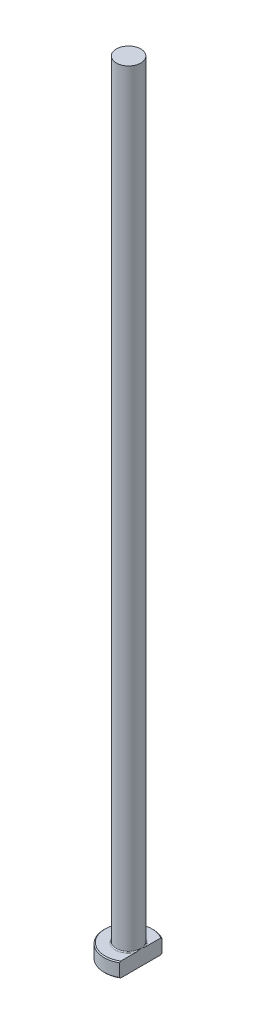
ISO-10303-21;
HEADER;
FILE_DESCRIPTION(('STEP AP214'),'2;1');
FILE_NAME('part.step','',(''),(''),'','','');
FILE_SCHEMA(('AUTOMOTIVE_DESIGN { 1 0 10303 214 1 1 1 1 }'));
ENDSEC;
DATA;
#1=APPLICATION_CONTEXT('core data for automotive mechanical design processes');
#2=APPLICATION_PROTOCOL_DEFINITION('international standard','automotive_design',2000,#1);
#3=PRODUCT_CONTEXT('',#1,'mechanical');
#4=PRODUCT('Part','Part','',(#3));
#5=PRODUCT_RELATED_PRODUCT_CATEGORY('part','',(#4));
#6=PRODUCT_DEFINITION_FORMATION('','',#4);
#7=PRODUCT_DEFINITION_CONTEXT('part definition',#1,'design');
#8=PRODUCT_DEFINITION('design','',#6,#7);
#9=PRODUCT_DEFINITION_SHAPE('','',#8);
#10=(LENGTH_UNIT() NAMED_UNIT(*) SI_UNIT(.MILLI.,.METRE.));
#11=(NAMED_UNIT(*) PLANE_ANGLE_UNIT() SI_UNIT($,.RADIAN.));
#12=(NAMED_UNIT(*) SI_UNIT($,.STERADIAN.) SOLID_ANGLE_UNIT());
#13=UNCERTAINTY_MEASURE_WITH_UNIT(LENGTH_MEASURE(1.E-05),#10,'distance_accuracy_value','');
#14=(GEOMETRIC_REPRESENTATION_CONTEXT(3) GLOBAL_UNCERTAINTY_ASSIGNED_CONTEXT((#13)) GLOBAL_UNIT_ASSIGNED_CONTEXT((#10,
#11,#12)) REPRESENTATION_CONTEXT('',''));
#15=CARTESIAN_POINT('',(0.,0.,0.));
#16=DIRECTION('',(0.,0.,1.));
#17=DIRECTION('',(1.,0.,0.));
#18=AXIS2_PLACEMENT_3D('',#15,#16,#17);
#19=CARTESIAN_POINT('',(0.,0.,0.));
#20=DIRECTION('',(0.,-1.,0.));
#21=DIRECTION('',(0.,0.,-1.));
#22=AXIS2_PLACEMENT_3D('',#19,#20,#21);
#23=PLANE('',#22);
#24=CARTESIAN_POINT('',(0.,0.,0.));
#25=DIRECTION('',(0.,-1.,0.));
#26=DIRECTION('',(0.,0.,-1.));
#27=AXIS2_PLACEMENT_3D('',#24,#25,#26);
#28=CIRCLE('',#27,4.79999999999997);
#29=CARTESIAN_POINT('',(2.49999999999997,0.,4.09756024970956));
#30=VERTEX_POINT('',#29);
#31=CARTESIAN_POINT('',(2.49999999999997,0.,-4.09756024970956));
#32=VERTEX_POINT('',#31);
#33=EDGE_CURVE('E98',#30,#32,#28,.T.);
#34=ORIENTED_EDGE('',*,*,#33,.T.);
#35=DIRECTION('',(0.,0.,1.));
#36=VECTOR('',#35,1.);
#37=CARTESIAN_POINT('',(2.49999999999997,0.,-4.33012701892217));
#38=LINE('',#37,#36);
#39=EDGE_CURVE('E83',#32,#30,#38,.T.);
#40=ORIENTED_EDGE('',*,*,#39,.T.);
#41=EDGE_LOOP('',(#34,#40));
#42=FACE_BOUND('',#41,.T.);
#43=ADVANCED_FACE('F32',(#42),#23,.T.);
#44=CARTESIAN_POINT('',(0.,259.958771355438,0.));
#45=DIRECTION('',(0.,1.,0.));
#46=DIRECTION('',(0.,0.,1.));
#47=AXIS2_PLACEMENT_3D('',#44,#45,#46);
#48=CYLINDRICAL_SURFACE('',#47,4.99999999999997);
#49=CARTESIAN_POINT('',(0.,2.80000000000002,0.));
#50=DIRECTION('',(0.,1.,0.));
#51=DIRECTION('',(0.,0.,1.));
#52=AXIS2_PLACEMENT_3D('',#49,#50,#51);
#53=CIRCLE('',#52,4.99999999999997);
#54=CARTESIAN_POINT('',(2.49999999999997,2.80000000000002,4.33012701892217));
#55=VERTEX_POINT('',#54);
#56=CARTESIAN_POINT('',(2.49999999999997,2.80000000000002,-4.33012701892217));
#57=VERTEX_POINT('',#56);
#58=EDGE_CURVE('E104',#55,#57,#53,.F.);
#59=ORIENTED_EDGE('',*,*,#58,.T.);
#60=DIRECTION('',(0.,-1.,0.));
#61=VECTOR('',#60,1.);
#62=CARTESIAN_POINT('',(2.49999999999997,160.,-4.33012701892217));
#63=LINE('',#62,#61);
#64=CARTESIAN_POINT('',(2.49999999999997,0.199999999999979,-4.33012701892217));
#65=VERTEX_POINT('',#64);
#66=EDGE_CURVE('E183',#57,#65,#63,.T.);
#67=ORIENTED_EDGE('',*,*,#66,.T.);
#68=CARTESIAN_POINT('',(0.,0.199999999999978,0.));
#69=DIRECTION('',(0.,-1.,0.));
#70=DIRECTION('',(0.,0.,-1.));
#71=AXIS2_PLACEMENT_3D('',#68,#69,#70);
#72=CIRCLE('',#71,4.99999999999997);
#73=CARTESIAN_POINT('',(2.49999999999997,0.199999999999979,4.33012701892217));
#74=VERTEX_POINT('',#73);
#75=EDGE_CURVE('E100',#65,#74,#72,.F.);
#76=ORIENTED_EDGE('',*,*,#75,.T.);
#77=DIRECTION('',(0.,-1.,0.));
#78=VECTOR('',#77,1.);
#79=CARTESIAN_POINT('',(2.49999999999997,160.,4.33012701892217));
#80=LINE('',#79,#78);
#81=EDGE_CURVE('E93',#55,#74,#80,.T.);
#82=ORIENTED_EDGE('',*,*,#81,.F.);
#83=EDGE_LOOP('',(#59,#67,#76,#82));
#84=FACE_BOUND('',#83,.T.);
#85=ADVANCED_FACE('F158',(#84),#48,.T.);
#86=CARTESIAN_POINT('',(-4.99999999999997,3.,0.));
#87=DIRECTION('',(0.,1.,0.));
#88=DIRECTION('',(0.,0.,1.));
#89=AXIS2_PLACEMENT_3D('',#86,#87,#88);
#90=PLANE('',#89);
#91=CARTESIAN_POINT('',(0.,3.,0.));
#92=DIRECTION('',(0.,1.,0.));
#93=DIRECTION('',(0.,0.,1.));
#94=AXIS2_PLACEMENT_3D('',#91,#92,#93);
#95=CIRCLE('',#94,4.80000000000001);
#96=CARTESIAN_POINT('',(2.49999999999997,3.,-4.09756024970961));
#97=VERTEX_POINT('',#96);
#98=CARTESIAN_POINT('',(2.49999999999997,3.,4.09756024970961));
#99=VERTEX_POINT('',#98);
#100=EDGE_CURVE('E178',#97,#99,#95,.T.);
#101=ORIENTED_EDGE('',*,*,#100,.T.);
#102=DIRECTION('',(0.,0.,-1.));
#103=VECTOR('',#102,1.);
#104=CARTESIAN_POINT('',(2.49999999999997,3.,0.));
#105=LINE('',#104,#103);
#106=CARTESIAN_POINT('',(2.49999999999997,2.99999999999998,1.01980390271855));
#107=VERTEX_POINT('',#106);
#108=EDGE_CURVE('E57',#99,#107,#105,.T.);
#109=ORIENTED_EDGE('',*,*,#108,.T.);
#110=CARTESIAN_POINT('',(0.,3.,0.));
#111=DIRECTION('',(0.,1.,0.));
#112=DIRECTION('',(0.,0.,1.));
#113=AXIS2_PLACEMENT_3D('',#110,#111,#112);
#114=CIRCLE('',#113,2.69999999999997);
#115=CARTESIAN_POINT('',(2.49999999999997,2.99999999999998,-1.01980390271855));
#116=VERTEX_POINT('',#115);
#117=EDGE_CURVE('E107',#107,#116,#114,.F.);
#118=ORIENTED_EDGE('',*,*,#117,.T.);
#119=EDGE_CURVE('E136',#116,#97,#105,.T.);
#120=ORIENTED_EDGE('',*,*,#119,.T.);
#121=EDGE_LOOP('',(#101,#109,#118,#120));
#122=FACE_BOUND('',#121,.T.);
#123=ADVANCED_FACE('F147',(#122),#90,.T.);
#124=CARTESIAN_POINT('',(0.,3.,0.));
#125=DIRECTION('',(0.,-1.,0.));
#126=DIRECTION('',(0.,0.,-1.));
#127=AXIS2_PLACEMENT_3D('',#124,#125,#126);
#128=CONICAL_SURFACE('',#127,4.80000000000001,0.785398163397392);
#129=ORIENTED_EDGE('',*,*,#58,.F.);
#130=CARTESIAN_POINT('',(2.49999999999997,-2.05039133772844,9.52786489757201));
#131=CARTESIAN_POINT('',(2.49999999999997,-1.84160367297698,9.31199733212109));
#132=CARTESIAN_POINT('',(2.49999999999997,-1.6330400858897,9.09591231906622));
#133=CARTESIAN_POINT('',(2.49999999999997,-1.21649358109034,8.66317810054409));
#134=CARTESIAN_POINT('',(2.49999999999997,-1.00851067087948,8.44652888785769));
#135=CARTESIAN_POINT('',(2.49999999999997,-0.593157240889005,8.01243155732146));
#136=CARTESIAN_POINT('',(2.49999999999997,-0.385787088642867,7.7949830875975));
#137=CARTESIAN_POINT('',(2.49999999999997,0.0280365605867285,7.35921771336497));
#138=CARTESIAN_POINT('',(2.49999999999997,0.23449006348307,7.14090081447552));
#139=CARTESIAN_POINT('',(2.49999999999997,0.642130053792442,6.70748960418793));
#140=CARTESIAN_POINT('',(2.49999999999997,0.843339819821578,6.49241720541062));
#141=CARTESIAN_POINT('',(2.49999999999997,1.24425381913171,6.06087422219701));
#142=CARTESIAN_POINT('',(2.49999999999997,1.44395806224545,5.84440364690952));
#143=CARTESIAN_POINT('',(2.49999999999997,1.84127751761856,5.4096366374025));
#144=CARTESIAN_POINT('',(2.49999999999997,2.03889317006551,5.19134060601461));
#145=CARTESIAN_POINT('',(2.49999999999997,2.43125043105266,4.75218509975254));
#146=CARTESIAN_POINT('',(2.49999999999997,2.62599215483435,4.53132572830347));
#147=CARTESIAN_POINT('',(2.49999999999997,2.93693788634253,4.17181619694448));
#148=CARTESIAN_POINT('',(2.49999999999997,3.054464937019,4.03431188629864));
#149=CARTESIAN_POINT('',(2.49999999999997,3.28742704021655,3.7575148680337));
#150=CARTESIAN_POINT('',(2.49999999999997,3.40286188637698,3.61822198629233));
#151=CARTESIAN_POINT('',(2.49999999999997,3.63213234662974,3.33586492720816));
#152=CARTESIAN_POINT('',(2.49999999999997,3.745938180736,3.19277645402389));
#153=CARTESIAN_POINT('',(2.49999999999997,3.96956266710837,2.90356071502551));
#154=CARTESIAN_POINT('',(2.49999999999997,4.07938227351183,2.75743418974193));
#155=CARTESIAN_POINT('',(2.49999999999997,4.29502410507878,2.45881038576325));
#156=CARTESIAN_POINT('',(2.49999999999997,4.40076032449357,2.30625006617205));
#157=CARTESIAN_POINT('',(2.49999999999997,4.55286945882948,2.07299325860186));
#158=CARTESIAN_POINT('',(2.49999999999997,4.6025261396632,1.99444197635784));
#159=CARTESIAN_POINT('',(2.49999999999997,4.6990816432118,1.83566827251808));
#160=CARTESIAN_POINT('',(2.49999999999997,4.7459807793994,1.75544604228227));
#161=CARTESIAN_POINT('',(2.49999999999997,4.83578466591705,1.59405362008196));
#162=CARTESIAN_POINT('',(2.49999999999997,4.87873126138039,1.51290702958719));
#163=CARTESIAN_POINT('',(2.49999999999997,4.96038600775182,1.34852090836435));
#164=CARTESIAN_POINT('',(2.49999999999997,4.99909338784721,1.26528100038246));
#165=CARTESIAN_POINT('',(2.49999999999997,5.10703093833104,1.01251774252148));
#166=CARTESIAN_POINT('',(2.49999999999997,5.16843307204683,0.839342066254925));
#167=CARTESIAN_POINT('',(2.49999999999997,5.23490554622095,0.579703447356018));
#168=CARTESIAN_POINT('',(2.49999999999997,5.25253806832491,0.496421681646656));
#169=CARTESIAN_POINT('',(2.49999999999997,5.27986337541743,0.328535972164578));
#170=CARTESIAN_POINT('',(2.49999999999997,5.28955686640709,0.24393214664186));
#171=CARTESIAN_POINT('',(2.49999999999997,5.30031768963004,0.0744340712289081));
#172=CARTESIAN_POINT('',(2.49999999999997,5.30141176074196,-0.0104584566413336));
#173=CARTESIAN_POINT('',(2.49999999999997,5.2949653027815,-0.179916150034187));
#174=CARTESIAN_POINT('',(2.49999999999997,5.28742406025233,-0.26448128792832));
#175=CARTESIAN_POINT('',(2.49999999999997,5.26433424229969,-0.43175473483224));
#176=CARTESIAN_POINT('',(2.49999999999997,5.24885436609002,-0.514472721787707));
#177=CARTESIAN_POINT('',(2.49999999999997,5.21085318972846,-0.678257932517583));
#178=CARTESIAN_POINT('',(2.49999999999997,5.18833104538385,-0.759324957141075));
#179=CARTESIAN_POINT('',(2.49999999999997,5.13718929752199,-0.920001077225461));
#180=CARTESIAN_POINT('',(2.49999999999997,5.10853534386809,-0.999599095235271));
#181=CARTESIAN_POINT('',(2.49999999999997,5.04628092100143,-1.1567927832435));
#182=CARTESIAN_POINT('',(2.49999999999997,5.0126814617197,-1.23438885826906));
#183=CARTESIAN_POINT('',(2.49999999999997,4.90558195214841,-1.46503672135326));
#184=CARTESIAN_POINT('',(2.49999999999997,4.82601567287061,-1.61526350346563));
#185=CARTESIAN_POINT('',(2.49999999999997,4.6563523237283,-1.90970759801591));
#186=CARTESIAN_POINT('',(2.49999999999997,4.56624199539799,-2.05391702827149));
#187=CARTESIAN_POINT('',(2.49999999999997,4.3786220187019,-2.33821627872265));
#188=CARTESIAN_POINT('',(2.49999999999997,4.28108460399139,-2.4782876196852));
#189=CARTESIAN_POINT('',(2.49999999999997,4.08116271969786,-2.75478641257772));
#190=CARTESIAN_POINT('',(2.49999999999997,3.97878070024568,-2.8912156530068));
#191=CARTESIAN_POINT('',(2.49999999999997,3.7691391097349,-3.16313520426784));
#192=CARTESIAN_POINT('',(2.49999999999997,3.66183307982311,-3.29858952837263));
#193=CARTESIAN_POINT('',(2.49999999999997,3.44456217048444,-3.56736427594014));
#194=CARTESIAN_POINT('',(2.49999999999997,3.33459700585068,-3.70068446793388));
#195=CARTESIAN_POINT('',(2.49999999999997,3.11293465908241,-3.96532340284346));
#196=CARTESIAN_POINT('',(2.49999999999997,3.00124232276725,-4.09664621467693));
#197=CARTESIAN_POINT('',(2.49999999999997,2.77631276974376,-4.35796341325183));
#198=CARTESIAN_POINT('',(2.49999999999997,2.66307552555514,-4.48795777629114));
#199=CARTESIAN_POINT('',(2.49999999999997,2.36028773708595,-4.83228553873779));
#200=CARTESIAN_POINT('',(2.49999999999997,2.16967435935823,-5.04568363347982));
#201=CARTESIAN_POINT('',(2.49999999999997,1.78611780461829,-5.4703791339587));
#202=CARTESIAN_POINT('',(2.49999999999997,1.59317456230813,-5.68167648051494));
#203=CARTESIAN_POINT('',(2.49999999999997,1.20540648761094,-6.10290357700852));
#204=CARTESIAN_POINT('',(2.49999999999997,1.01058005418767,-6.3128318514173));
#205=CARTESIAN_POINT('',(2.49999999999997,0.619649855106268,-6.73149551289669));
#206=CARTESIAN_POINT('',(2.49999999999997,0.423546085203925,-6.94023089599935));
#207=CARTESIAN_POINT('',(2.49999999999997,0.038443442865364,-7.34820392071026));
#208=CARTESIAN_POINT('',(2.49999999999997,-0.150515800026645,-7.54747899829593));
#209=CARTESIAN_POINT('',(2.49999999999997,-0.529153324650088,-7.94534601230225));
#210=CARTESIAN_POINT('',(2.49999999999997,-0.718831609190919,-8.14393794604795));
#211=CARTESIAN_POINT('',(2.49999999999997,-1.09855461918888,-8.54034636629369));
#212=CARTESIAN_POINT('',(2.49999999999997,-1.28859869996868,-8.7381634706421));
#213=CARTESIAN_POINT('',(2.49999999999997,-1.66916268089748,-9.13333639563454));
#214=CARTESIAN_POINT('',(2.49999999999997,-1.85968257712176,-9.33069222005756));
#215=CARTESIAN_POINT('',(2.49999999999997,-2.05039133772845,-9.52786489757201));
#216=B_SPLINE_CURVE_WITH_KNOTS('',3,(#130,#131,#132,#133,#134,#135,#136,#137,#138,#139,#140,
#141,#142,#143,#144,#145,#146,#147,#148,#149,#150,#151,#152,#153,#154,#155,#156,#157,#158,#159,
#160,#161,#162,#163,#164,#165,#166,#167,#168,#169,#170,#171,#172,#173,#174,#175,#176,#177,#178,
#179,#180,#181,#182,#183,#184,#185,#186,#187,#188,#189,#190,#191,#192,#193,#194,#195,#196,#197,
#198,#199,#200,#201,#202,#203,#204,#205,#206,#207,#208,#209,#210,#211,#212,#213,#214,#215),
.UNSPECIFIED.,.F.,.F.,(4,2,2,2,2,2,2,2,2,2,2,2,2,2,2,2,2,2,2,2,2,2,2,2,2,2,2,2,2,2,2,2,2,2,2,2,
2,2,2,2,2,2,4),(0.,0.900955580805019,1.80192274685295,2.70335062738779,3.60477268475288,
4.48832484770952,5.37187123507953,6.25522753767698,7.13854832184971,7.68119321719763,
8.22389134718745,8.77232299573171,9.32062249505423,9.87724663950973,10.1559936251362,
10.4347088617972,10.7100145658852,10.9853702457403,11.5339745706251,11.7890461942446,
12.0440951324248,12.2983507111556,12.5526272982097,12.8047396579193,13.0568822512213,
13.3104761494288,13.564018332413,14.0732618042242,14.5831526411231,15.0950533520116,
15.6066978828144,16.125075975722,16.6435099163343,17.1606868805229,17.6778730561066,
18.5362451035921,19.3946412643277,20.2538459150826,21.1130534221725,21.9369112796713,
22.7607723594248,23.5837145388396,24.406649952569),.UNSPECIFIED.);
#217=EDGE_CURVE('E135',#55,#99,#216,.T.);
#218=ORIENTED_EDGE('',*,*,#217,.T.);
#219=ORIENTED_EDGE('',*,*,#100,.F.);
#220=EDGE_CURVE('E127',#97,#57,#216,.T.);
#221=ORIENTED_EDGE('',*,*,#220,.T.);
#222=EDGE_LOOP('',(#129,#218,#219,#221));
#223=FACE_BOUND('',#222,.T.);
#224=ADVANCED_FACE('F143',(#223),#128,.T.);
#225=CARTESIAN_POINT('',(0.,0.199999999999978,0.));
#226=DIRECTION('',(0.,1.,0.));
#227=DIRECTION('',(0.,0.,1.));
#228=AXIS2_PLACEMENT_3D('',#225,#226,#227);
#229=CONICAL_SURFACE('',#228,4.99999999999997,0.785398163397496);
#230=ORIENTED_EDGE('',*,*,#75,.F.);
#231=CARTESIAN_POINT('',(2.49999999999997,5.05039133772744,-9.52786489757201));
#232=CARTESIAN_POINT('',(2.49999999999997,4.84160367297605,-9.31199733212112));
#233=CARTESIAN_POINT('',(2.49999999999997,4.63304008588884,-9.09591231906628));
#234=CARTESIAN_POINT('',(2.49999999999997,4.21649358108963,-8.66317810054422));
#235=CARTESIAN_POINT('',(2.49999999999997,4.00851067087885,-8.44652888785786));
#236=CARTESIAN_POINT('',(2.49999999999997,3.59315724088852,-8.01243155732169));
#237=CARTESIAN_POINT('',(2.49999999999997,3.38578708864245,-7.79498308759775));
#238=CARTESIAN_POINT('',(2.49999999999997,2.97196343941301,-7.35921771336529));
#239=CARTESIAN_POINT('',(2.49999999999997,2.76550993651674,-7.14090081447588));
#240=CARTESIAN_POINT('',(2.49999999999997,2.35786994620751,-6.70748960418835));
#241=CARTESIAN_POINT('',(2.49999999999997,2.15666018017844,-6.49241720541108));
#242=CARTESIAN_POINT('',(2.49999999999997,1.75574618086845,-6.06087422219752));
#243=CARTESIAN_POINT('',(2.49999999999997,1.55604193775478,-5.84440364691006));
#244=CARTESIAN_POINT('',(2.49999999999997,1.1587224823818,-5.40963663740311));
#245=CARTESIAN_POINT('',(2.49999999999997,0.961106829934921,-5.19134060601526));
#246=CARTESIAN_POINT('',(2.49999999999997,0.568749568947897,-4.75218509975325));
#247=CARTESIAN_POINT('',(2.49999999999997,0.374007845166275,-4.53132572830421));
#248=CARTESIAN_POINT('',(2.49999999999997,0.0630621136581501,-4.17181619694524));
#249=CARTESIAN_POINT('',(2.49999999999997,-0.0544649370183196,-4.03431188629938));
#250=CARTESIAN_POINT('',(2.49999999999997,-0.287427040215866,-3.75751486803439));
#251=CARTESIAN_POINT('',(2.49999999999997,-0.402861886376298,-3.618221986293));
#252=CARTESIAN_POINT('',(2.49999999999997,-0.632132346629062,-3.33586492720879));
#253=CARTESIAN_POINT('',(2.49999999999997,-0.745938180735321,-3.1927764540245));
#254=CARTESIAN_POINT('',(2.49999999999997,-0.969562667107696,-2.90356071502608));
#255=CARTESIAN_POINT('',(2.49999999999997,-1.07938227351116,-2.75743418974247));
#256=CARTESIAN_POINT('',(2.49999999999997,-1.29502410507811,-2.45881038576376));
#257=CARTESIAN_POINT('',(2.49999999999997,-1.4007603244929,-2.30625006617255));
#258=CARTESIAN_POINT('',(2.49999999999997,-1.55286945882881,-2.07299325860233));
#259=CARTESIAN_POINT('',(2.49999999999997,-1.60252613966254,-1.99444197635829));
#260=CARTESIAN_POINT('',(2.49999999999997,-1.69908164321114,-1.83566827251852));
#261=CARTESIAN_POINT('',(2.49999999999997,-1.74598077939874,-1.75544604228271));
#262=CARTESIAN_POINT('',(2.49999999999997,-1.83578466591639,-1.59405362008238));
#263=CARTESIAN_POINT('',(2.49999999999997,-1.87873126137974,-1.5129070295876));
#264=CARTESIAN_POINT('',(2.49999999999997,-1.96038600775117,-1.34852090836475));
#265=CARTESIAN_POINT('',(2.49999999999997,-1.99909338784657,-1.26528100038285));
#266=CARTESIAN_POINT('',(2.49999999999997,-2.10703093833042,-1.01251774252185));
#267=CARTESIAN_POINT('',(2.49999999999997,-2.16843307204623,-0.839342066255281));
#268=CARTESIAN_POINT('',(2.49999999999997,-2.23490554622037,-0.579703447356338));
#269=CARTESIAN_POINT('',(2.49999999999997,-2.25253806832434,-0.496421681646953));
#270=CARTESIAN_POINT('',(2.49999999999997,-2.27986337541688,-0.328535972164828));
#271=CARTESIAN_POINT('',(2.49999999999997,-2.28955686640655,-0.243932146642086));
#272=CARTESIAN_POINT('',(2.49999999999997,-2.30031768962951,-0.0744340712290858));
#273=CARTESIAN_POINT('',(2.49999999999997,-2.30141176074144,0.01045845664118));
#274=CARTESIAN_POINT('',(2.49999999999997,-2.29496530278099,0.179916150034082));
#275=CARTESIAN_POINT('',(2.49999999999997,-2.28742406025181,0.26448128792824));
#276=CARTESIAN_POINT('',(2.49999999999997,-2.26433424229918,0.431754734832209));
#277=CARTESIAN_POINT('',(2.49999999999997,-2.24885436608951,0.514472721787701));
#278=CARTESIAN_POINT('',(2.49999999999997,-2.21085318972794,0.678257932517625));
#279=CARTESIAN_POINT('',(2.49999999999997,-2.18833104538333,0.759324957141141));
#280=CARTESIAN_POINT('',(2.49999999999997,-2.13718929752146,0.920001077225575));
#281=CARTESIAN_POINT('',(2.49999999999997,-2.10853534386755,0.999599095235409));
#282=CARTESIAN_POINT('',(2.49999999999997,-2.04628092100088,1.15679278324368));
#283=CARTESIAN_POINT('',(2.49999999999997,-2.01268146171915,1.23438885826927));
#284=CARTESIAN_POINT('',(2.49999999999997,-1.90558195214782,1.46503672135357));
#285=CARTESIAN_POINT('',(2.49999999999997,-1.82601567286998,1.61526350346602));
#286=CARTESIAN_POINT('',(2.49999999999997,-1.6563523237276,1.90970759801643));
#287=CARTESIAN_POINT('',(2.49999999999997,-1.56624199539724,2.05391702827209));
#288=CARTESIAN_POINT('',(2.49999999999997,-1.37862201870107,2.33821627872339));
#289=CARTESIAN_POINT('',(2.49999999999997,-1.28108460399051,2.478287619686));
#290=CARTESIAN_POINT('',(2.49999999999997,-1.08116271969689,2.75478641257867));
#291=CARTESIAN_POINT('',(2.49999999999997,-0.978780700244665,2.89121565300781));
#292=CARTESIAN_POINT('',(2.49999999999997,-0.7691391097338,3.16313520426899));
#293=CARTESIAN_POINT('',(2.49999999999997,-0.66183307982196,3.29858952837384));
#294=CARTESIAN_POINT('',(2.49999999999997,-0.444562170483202,3.56736427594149));
#295=CARTESIAN_POINT('',(2.49999999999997,-0.33459700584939,3.7006844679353));
#296=CARTESIAN_POINT('',(2.49999999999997,-0.112934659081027,3.96532340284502));
#297=CARTESIAN_POINT('',(2.49999999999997,-0.00124232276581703,4.09664621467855));
#298=CARTESIAN_POINT('',(2.49999999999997,0.223687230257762,4.35796341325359));
#299=CARTESIAN_POINT('',(2.49999999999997,0.336924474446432,4.48795777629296));
#300=CARTESIAN_POINT('',(2.49999999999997,0.639712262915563,4.83228553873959));
#301=CARTESIAN_POINT('',(2.49999999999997,0.83032564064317,5.04568363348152));
#302=CARTESIAN_POINT('',(2.49999999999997,1.21388219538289,5.47037913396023));
#303=CARTESIAN_POINT('',(2.49999999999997,1.40682543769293,5.68167648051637));
#304=CARTESIAN_POINT('',(2.49999999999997,1.7945935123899,6.10290357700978));
#305=CARTESIAN_POINT('',(2.49999999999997,1.98941994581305,6.31283185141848));
#306=CARTESIAN_POINT('',(2.49999999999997,2.38035014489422,6.73149551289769));
#307=CARTESIAN_POINT('',(2.49999999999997,2.57645391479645,6.94023089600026));
#308=CARTESIAN_POINT('',(2.49999999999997,2.96155655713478,7.34820392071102));
#309=CARTESIAN_POINT('',(2.49999999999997,3.15051580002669,7.54747899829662));
#310=CARTESIAN_POINT('',(2.49999999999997,3.52915332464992,7.9453460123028));
#311=CARTESIAN_POINT('',(2.49999999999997,3.71883160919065,8.14393794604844));
#312=CARTESIAN_POINT('',(2.49999999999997,4.0985546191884,8.54034636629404));
#313=CARTESIAN_POINT('',(2.49999999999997,4.2885986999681,8.73816347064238));
#314=CARTESIAN_POINT('',(2.49999999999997,4.66916268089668,9.13333639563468));
#315=CARTESIAN_POINT('',(2.49999999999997,4.85968257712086,9.33069222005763));
#316=CARTESIAN_POINT('',(2.49999999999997,5.05039133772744,9.52786489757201));
#317=B_SPLINE_CURVE_WITH_KNOTS('',3,(#231,#232,#233,#234,#235,#236,#237,#238,#239,#240,#241,
#242,#243,#244,#245,#246,#247,#248,#249,#250,#251,#252,#253,#254,#255,#256,#257,#258,#259,#260,
#261,#262,#263,#264,#265,#266,#267,#268,#269,#270,#271,#272,#273,#274,#275,#276,#277,#278,#279,
#280,#281,#282,#283,#284,#285,#286,#287,#288,#289,#290,#291,#292,#293,#294,#295,#296,#297,#298,
#299,#300,#301,#302,#303,#304,#305,#306,#307,#308,#309,#310,#311,#312,#313,#314,#315,#316),
.UNSPECIFIED.,.F.,.F.,(4,2,2,2,2,2,2,2,2,2,2,2,2,2,2,2,2,2,2,2,2,2,2,2,2,2,2,2,2,2,2,2,2,2,2,2,
2,2,2,2,2,2,4),(0.,0.900955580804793,1.8019227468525,2.70335062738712,3.60477268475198,
4.48832484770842,5.37187123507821,6.25522753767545,7.13854832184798,7.68119321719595,
8.22389134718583,8.77232299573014,9.32062249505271,9.87724663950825,10.1559936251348,
10.4347088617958,10.7100145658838,10.9853702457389,11.5339745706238,11.7890461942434,
12.0440951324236,12.2983507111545,12.5526272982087,12.8047396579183,13.0568822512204,
13.310476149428,13.5640183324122,14.0732618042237,14.5831526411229,15.0950533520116,
15.6066978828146,16.1250759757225,16.643509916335,17.1606868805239,17.6778730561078,
18.5362451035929,19.3946412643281,20.2538459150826,21.113053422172,21.9369112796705,
22.7607723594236,23.583714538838,24.4066499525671),.UNSPECIFIED.);
#318=EDGE_CURVE('E86',#65,#32,#317,.T.);
#319=ORIENTED_EDGE('',*,*,#318,.T.);
#320=ORIENTED_EDGE('',*,*,#33,.F.);
#321=EDGE_CURVE('E89',#30,#74,#317,.T.);
#322=ORIENTED_EDGE('',*,*,#321,.T.);
#323=EDGE_LOOP('',(#230,#319,#320,#322));
#324=FACE_BOUND('',#323,.T.);
#325=ADVANCED_FACE('F97',(#324),#229,.T.);
#326=CARTESIAN_POINT('',(0.,3.19999999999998,0.));
#327=DIRECTION('',(0.,1.,0.));
#328=DIRECTION('',(0.,0.,1.));
#329=AXIS2_PLACEMENT_3D('',#326,#327,#328);
#330=TOROIDAL_SURFACE('',#329,2.69999999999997,0.2);
#331=CARTESIAN_POINT('',(2.49999999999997,3.19999999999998,0.));
#332=CARTESIAN_POINT('',(2.49999999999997,3.20000050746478,5.29061312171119E-11));
#333=CARTESIAN_POINT('',(2.49999999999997,3.20000101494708,-1.70517157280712E-07));
#334=CARTESIAN_POINT('',(2.49999999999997,3.20000196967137,-6.59443804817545E-07));
#335=CARTESIAN_POINT('',(2.49999999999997,3.20000240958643,-9.87883924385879E-07));
#336=CARTESIAN_POINT('',(2.49999999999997,3.20000331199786,-1.7724689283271E-06));
#337=CARTESIAN_POINT('',(2.49999999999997,3.20000376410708,-2.24097229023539E-06));
#338=CARTESIAN_POINT('',(2.49999999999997,3.20000458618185,-3.2218605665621E-06));
#339=CARTESIAN_POINT('',(2.49999999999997,3.20000495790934,-3.73286586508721E-06));
#340=CARTESIAN_POINT('',(2.49999999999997,3.20000630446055,-5.67453781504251E-06));
#341=CARTESIAN_POINT('',(2.49999999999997,3.20000720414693,-7.15943624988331E-06));
#342=CARTESIAN_POINT('',(2.49999999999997,3.20000871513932,-1.01304383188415E-05));
#343=CARTESIAN_POINT('',(2.49999999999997,3.20000934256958,-1.16087237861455E-05));
#344=CARTESIAN_POINT('',(2.49999999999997,3.20001191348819,-1.77555555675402E-05));
#345=CARTESIAN_POINT('',(2.49999999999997,3.20001378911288,-2.24564506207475E-05));
#346=CARTESIAN_POINT('',(2.49999999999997,3.20001661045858,-3.14167101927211E-05));
#347=CARTESIAN_POINT('',(2.49999999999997,3.20001764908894,-3.56468503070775E-05));
#348=CARTESIAN_POINT('',(2.49999999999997,3.20002511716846,-6.67543462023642E-05));
#349=CARTESIAN_POINT('',(2.49999999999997,3.20003067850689,-9.37930225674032E-05));
#350=CARTESIAN_POINT('',(2.49999999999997,3.20005501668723,-0.000200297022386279));
#351=CARTESIAN_POINT('',(2.49999999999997,3.20007833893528,-0.000278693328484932));
#352=CARTESIAN_POINT('',(2.49999999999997,3.20016883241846,-0.000588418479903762));
#353=CARTESIAN_POINT('',(2.49999999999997,3.2002329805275,-0.000820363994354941));
#354=CARTESIAN_POINT('',(2.49999999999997,3.20048923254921,-0.00173961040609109));
#355=CARTESIAN_POINT('',(2.49999999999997,3.20068508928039,-0.00242612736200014));
#356=CARTESIAN_POINT('',(2.49999999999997,3.201497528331,-0.00528196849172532));
#357=CARTESIAN_POINT('',(2.49999999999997,3.20210941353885,-0.0074522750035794));
#358=CARTESIAN_POINT('',(2.49999999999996,3.20774599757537,-0.0274346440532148));
#359=CARTESIAN_POINT('',(2.49999999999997,3.21279017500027,-0.0452427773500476));
#360=CARTESIAN_POINT('',(2.49999999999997,3.22264347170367,-0.080167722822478));
#361=CARTESIAN_POINT('',(2.49999999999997,3.22745402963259,-0.0972841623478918));
#362=CARTESIAN_POINT('',(2.49999999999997,3.23763483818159,-0.133672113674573));
#363=CARTESIAN_POINT('',(2.49999999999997,3.24299975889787,-0.15294514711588));
#364=CARTESIAN_POINT('',(2.49999999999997,3.25370389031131,-0.191722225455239));
#365=CARTESIAN_POINT('',(2.49999999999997,3.25904219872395,-0.211226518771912));
#366=CARTESIAN_POINT('',(2.49999999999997,3.27184445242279,-0.258540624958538));
#367=CARTESIAN_POINT('',(2.49999999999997,3.27925018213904,-0.286366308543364));
#368=CARTESIAN_POINT('',(2.49999999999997,3.29355148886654,-0.341371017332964));
#369=CARTESIAN_POINT('',(2.49999999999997,3.30045534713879,-0.368547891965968));
#370=CARTESIAN_POINT('',(2.49999999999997,3.31991129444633,-0.447507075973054));
#371=CARTESIAN_POINT('',(2.49999999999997,3.33195369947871,-0.499417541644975));
#372=CARTESIAN_POINT('',(2.49999999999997,3.35404241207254,-0.60418810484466));
#373=CARTESIAN_POINT('',(2.49999999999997,3.36406867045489,-0.657052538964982));
#374=CARTESIAN_POINT('',(2.49999999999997,3.38176575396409,-0.767598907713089));
#375=CARTESIAN_POINT('',(2.49999999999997,3.38917909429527,-0.825323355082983));
#376=CARTESIAN_POINT('',(2.49999999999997,3.39884096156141,-0.94105511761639));
#377=CARTESIAN_POINT('',(2.49999999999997,3.40111055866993,-0.999060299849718));
#378=CARTESIAN_POINT('',(2.49999999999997,3.39847691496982,-1.09324578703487));
#379=CARTESIAN_POINT('',(2.49999999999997,3.39593644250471,-1.12948454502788));
#380=CARTESIAN_POINT('',(2.49999999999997,3.38674319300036,-1.20096926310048));
#381=CARTESIAN_POINT('',(2.49999999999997,3.38015410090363,-1.2362219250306));
#382=CARTESIAN_POINT('',(2.49999999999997,3.36639936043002,-1.28579148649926));
#383=CARTESIAN_POINT('',(2.49999999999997,3.36162670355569,-1.30076836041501));
#384=CARTESIAN_POINT('',(2.49999999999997,3.35062798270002,-1.33028325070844));
#385=CARTESIAN_POINT('',(2.49999999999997,3.34439458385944,-1.34481861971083));
#386=CARTESIAN_POINT('',(2.49999999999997,3.33003808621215,-1.37319413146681));
#387=CARTESIAN_POINT('',(2.49999999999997,3.32189015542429,-1.38702194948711));
#388=CARTESIAN_POINT('',(2.49999999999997,3.30325367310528,-1.4129811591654));
#389=CARTESIAN_POINT('',(2.49999999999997,3.2927824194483,-1.42512406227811));
#390=CARTESIAN_POINT('',(2.49999999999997,3.27569207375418,-1.44029611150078));
#391=CARTESIAN_POINT('',(2.49999999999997,3.27021837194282,-1.4446101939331));
#392=CARTESIAN_POINT('',(2.49999999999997,3.25870897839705,-1.45242709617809));
#393=CARTESIAN_POINT('',(2.49999999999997,3.25267333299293,-1.45592998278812));
#394=CARTESIAN_POINT('',(2.49999999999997,3.24001938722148,-1.46191450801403));
#395=CARTESIAN_POINT('',(2.49999999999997,3.233395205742,-1.46438399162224));
#396=CARTESIAN_POINT('',(2.49999999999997,3.21979347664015,-1.46798853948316));
#397=CARTESIAN_POINT('',(2.49999999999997,3.21281651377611,-1.46912574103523));
#398=CARTESIAN_POINT('',(2.49999999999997,3.19961348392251,-1.46988240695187));
#399=CARTESIAN_POINT('',(2.49999999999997,3.19339654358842,-1.46966594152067));
#400=CARTESIAN_POINT('',(2.49999999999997,3.18110362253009,-1.46811597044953));
#401=CARTESIAN_POINT('',(2.49999999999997,3.17502769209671,-1.46678207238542));
#402=CARTESIAN_POINT('',(2.49999999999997,3.16354702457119,-1.46323301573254));
#403=CARTESIAN_POINT('',(2.49999999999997,3.15812390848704,-1.46107586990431));
#404=CARTESIAN_POINT('',(2.49999999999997,3.14763458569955,-1.45603007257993));
#405=CARTESIAN_POINT('',(2.49999999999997,3.14256845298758,-1.45314127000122));
#406=CARTESIAN_POINT('',(2.49999999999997,3.12963191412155,-1.44468844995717));
#407=CARTESIAN_POINT('',(2.49999999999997,3.12209714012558,-1.43861122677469));
#408=CARTESIAN_POINT('',(2.49999999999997,3.10805350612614,-1.42536327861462));
#409=CARTESIAN_POINT('',(2.49999999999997,3.10154826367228,-1.418188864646));
#410=CARTESIAN_POINT('',(2.49999999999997,3.08513615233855,-1.39772885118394));
#411=CARTESIAN_POINT('',(2.49999999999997,3.07611692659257,-1.38373739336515));
#412=CARTESIAN_POINT('',(2.49999999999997,3.06018433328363,-1.35465370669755));
#413=CARTESIAN_POINT('',(2.49999999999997,3.0532724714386,-1.33956070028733));
#414=CARTESIAN_POINT('',(2.49999999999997,3.04107204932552,-1.30868385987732));
#415=CARTESIAN_POINT('',(2.49999999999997,3.03578911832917,-1.29289784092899));
#416=CARTESIAN_POINT('',(2.49999999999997,3.02655583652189,-1.26093375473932));
#417=CARTESIAN_POINT('',(2.49999999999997,3.0226069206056,-1.24475528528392));
#418=CARTESIAN_POINT('',(2.49999999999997,3.01232854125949,-1.19551094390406));
#419=CARTESIAN_POINT('',(2.49999999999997,3.00769429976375,-1.16209442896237));
#420=CARTESIAN_POINT('',(2.49999999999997,3.00005311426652,-1.07761506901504));
#421=CARTESIAN_POINT('',(2.49999999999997,2.99913690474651,-1.02638928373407));
#422=CARTESIAN_POINT('',(2.49999999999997,3.00223345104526,-0.923947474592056));
#423=CARTESIAN_POINT('',(2.49999999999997,3.00626667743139,-0.872732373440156));
#424=CARTESIAN_POINT('',(2.49999999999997,3.01749958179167,-0.773934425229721));
#425=CARTESIAN_POINT('',(2.49999999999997,3.02448410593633,-0.72632575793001));
#426=CARTESIAN_POINT('',(2.49999999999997,3.04066526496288,-0.631906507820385));
#427=CARTESIAN_POINT('',(2.49999999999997,3.0498429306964,-0.585092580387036));
#428=CARTESIAN_POINT('',(2.49999999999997,3.06791405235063,-0.500780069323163));
#429=CARTESIAN_POINT('',(2.49999999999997,3.07652349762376,-0.463219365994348));
#430=CARTESIAN_POINT('',(2.49999999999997,3.09478102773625,-0.387318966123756));
#431=CARTESIAN_POINT('',(2.49999999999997,3.10445029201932,-0.348984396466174));
#432=CARTESIAN_POINT('',(2.49999999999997,3.12135487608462,-0.284095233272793));
#433=CARTESIAN_POINT('',(2.49999999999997,3.12843710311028,-0.257500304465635));
#434=CARTESIAN_POINT('',(2.49999999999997,3.14273562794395,-0.204655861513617));
#435=CARTESIAN_POINT('',(2.49999999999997,3.1499496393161,-0.178405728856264));
#436=CARTESIAN_POINT('',(2.49999999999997,3.1636921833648,-0.128877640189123));
#437=CARTESIAN_POINT('',(2.49999999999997,3.17020707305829,-0.10559584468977));
#438=CARTESIAN_POINT('',(2.49999999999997,3.18358099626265,-0.0580847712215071));
#439=CARTESIAN_POINT('',(2.49999999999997,3.19044308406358,-0.033856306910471));
#440=CARTESIAN_POINT('',(2.49999999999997,3.19789108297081,-0.00745034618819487));
#441=CARTESIAN_POINT('',(2.49999999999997,3.198503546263,-0.00527812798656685));
#442=CARTESIAN_POINT('',(2.49999999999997,3.1993161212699,-0.0024218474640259));
#443=CARTESIAN_POINT('',(2.49999999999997,3.19951155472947,-0.00173680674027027));
#444=CARTESIAN_POINT('',(2.49999999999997,3.19976729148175,-0.000819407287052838));
#445=CARTESIAN_POINT('',(2.49999999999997,3.19983133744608,-0.00058783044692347));
#446=CARTESIAN_POINT('',(2.49999999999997,3.19992170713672,-0.000278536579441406));
#447=CARTESIAN_POINT('',(2.49999999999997,3.19994501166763,-0.000200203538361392));
#448=CARTESIAN_POINT('',(2.49999999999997,3.19996933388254,-9.3772760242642E-05));
#449=CARTESIAN_POINT('',(2.49999999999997,3.19997489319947,-6.67431741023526E-05));
#450=CARTESIAN_POINT('',(2.49999999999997,3.1999823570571,-3.56449049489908E-05));
#451=CARTESIAN_POINT('',(2.49999999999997,3.19998339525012,-3.14152905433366E-05));
#452=CARTESIAN_POINT('',(2.49999999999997,3.19998621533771,-2.24560901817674E-05));
#453=CARTESIAN_POINT('',(2.49999999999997,3.19998809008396,-1.77557009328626E-05));
#454=CARTESIAN_POINT('',(2.49999999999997,3.19999065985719,-1.16093871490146E-05));
#455=CARTESIAN_POINT('',(2.49999999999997,3.1999912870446,-1.01311410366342E-05));
#456=CARTESIAN_POINT('',(2.49999999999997,3.19999279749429,-7.16017592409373E-06));
#457=CARTESIAN_POINT('',(2.49999999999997,3.19999369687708,-5.67527054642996E-06));
#458=CARTESIAN_POINT('',(2.49999999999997,3.19999504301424,-3.73354014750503E-06));
#459=CARTESIAN_POINT('',(2.49999999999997,3.19999541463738,-3.22250653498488E-06));
#460=CARTESIAN_POINT('',(2.49999999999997,3.19999623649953,-2.24154280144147E-06));
#461=CARTESIAN_POINT('',(2.49999999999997,3.19999668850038,-1.77299174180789E-06));
#462=CARTESIAN_POINT('',(2.49999999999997,3.19999759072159,-9.88293774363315E-07));
#463=CARTESIAN_POINT('',(2.49999999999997,3.19999803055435,-6.59792278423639E-07));
#464=CARTESIAN_POINT('',(2.49999999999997,3.19999898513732,-1.7071215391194E-07));
#465=CARTESIAN_POINT('',(2.49999999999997,3.1999994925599,-5.29035539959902E-11));
#466=CARTESIAN_POINT('',(2.49999999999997,3.19999999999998,0.));
#467=B_SPLINE_CURVE_WITH_KNOTS('',3,(#331,#332,#333,#334,#335,#336,#337,#338,#339,#340,#341,
#342,#343,#344,#345,#346,#347,#348,#349,#350,#351,#352,#353,#354,#355,#356,#357,#358,#359,#360,
#361,#362,#363,#364,#365,#366,#367,#368,#369,#370,#371,#372,#373,#374,#375,#376,#377,#378,#379,
#380,#381,#382,#383,#384,#385,#386,#387,#388,#389,#390,#391,#392,#393,#394,#395,#396,#397,#398,
#399,#400,#401,#402,#403,#404,#405,#406,#407,#408,#409,#410,#411,#412,#413,#414,#415,#416,#417,
#418,#419,#420,#421,#422,#423,#424,#425,#426,#427,#428,#429,#430,#431,#432,#433,#434,#435,#436,
#437,#438,#439,#440,#441,#442,#443,#444,#445,#446,#447,#448,#449,#450,#451,#452,#453,#454,#455,
#456,#457,#458,#459,#460,#461,#462,#463,#464,#465,#466),.UNSPECIFIED.,.T.,.F.,(4,2,2,2,2,2,2,2,
2,2,2,2,2,2,2,2,2,2,2,2,2,2,2,2,2,2,2,2,2,2,2,2,2,2,2,2,2,2,2,2,2,2,2,2,2,2,2,2,2,2,2,2,2,2,2,2,
2,2,2,2,2,2,2,2,2,2,2,4),(0.,1.53002989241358E-06,3.17429895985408E-06,5.11692917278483E-06,
7.01128942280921E-06,1.21993179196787E-05,1.70129966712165E-05,3.21659460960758E-05,
4.52166487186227E-05,0.000128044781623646,0.000373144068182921,0.00109538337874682,
0.00323676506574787,0.0100018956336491,0.0655261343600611,0.118865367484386,0.178882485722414,
0.239547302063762,0.325928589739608,0.410047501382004,0.56988542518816,0.731241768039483,
0.905704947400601,1.07945217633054,1.18829443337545,1.2954669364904,1.34257193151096,
1.38991872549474,1.43791728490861,1.4855698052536,1.50642342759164,1.52727533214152,
1.54836603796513,1.56942286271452,1.58798129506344,1.60654624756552,1.62399133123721,
1.64144002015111,1.67031274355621,1.69928476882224,1.74894310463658,1.79863683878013,
1.84850042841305,1.8984174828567,1.99938099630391,2.1527113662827,2.30667804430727,
2.45095908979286,2.59403470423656,2.70962861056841,2.8282269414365,2.91079145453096,
2.99246070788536,3.06498967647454,3.14053132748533,3.14730244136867,3.14943921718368,
3.15016030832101,3.15040521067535,3.15048801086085,3.15050105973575,3.1505162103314,
3.15052102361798,3.15052621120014,3.1505281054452,3.15053004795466,3.15053169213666,
3.15053322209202),.UNSPECIFIED.);
#468=CARTESIAN_POINT('',(2.49999999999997,3.19999999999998,0.));
#469=VERTEX_POINT('',#468);
#470=EDGE_CURVE('E11',#116,#469,#467,.T.);
#471=ORIENTED_EDGE('',*,*,#470,.F.);
#472=ORIENTED_EDGE('',*,*,#117,.F.);
#473=CARTESIAN_POINT('',(2.49999999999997,3.19999999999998,0.));
#474=CARTESIAN_POINT('',(2.49999999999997,3.19999949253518,-5.29060891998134E-11));
#475=CARTESIAN_POINT('',(2.49999999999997,3.19999898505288,1.70517157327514E-07));
#476=CARTESIAN_POINT('',(2.49999999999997,3.19999803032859,6.59443804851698E-07));
#477=CARTESIAN_POINT('',(2.49999999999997,3.19999759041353,9.87883924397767E-07));
#478=CARTESIAN_POINT('',(2.49999999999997,3.19999668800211,1.77246892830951E-06));
#479=CARTESIAN_POINT('',(2.49999999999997,3.19999623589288,2.24097229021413E-06));
#480=CARTESIAN_POINT('',(2.49999999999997,3.19999541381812,3.22186056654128E-06));
#481=CARTESIAN_POINT('',(2.49999999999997,3.19999504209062,3.73286586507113E-06));
#482=CARTESIAN_POINT('',(2.49999999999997,3.19999369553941,5.67453781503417E-06));
#483=CARTESIAN_POINT('',(2.49999999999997,3.19999279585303,7.15943624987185E-06));
#484=CARTESIAN_POINT('',(2.49999999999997,3.19999128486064,1.01304383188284E-05));
#485=CARTESIAN_POINT('',(2.49999999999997,3.19999065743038,1.1608723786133E-05));
#486=CARTESIAN_POINT('',(2.49999999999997,3.19998808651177,1.77555555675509E-05));
#487=CARTESIAN_POINT('',(2.49999999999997,3.19998621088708,2.24564506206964E-05));
#488=CARTESIAN_POINT('',(2.49999999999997,3.19998338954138,3.14167101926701E-05));
#489=CARTESIAN_POINT('',(2.49999999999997,3.19998235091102,3.56468503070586E-05));
#490=CARTESIAN_POINT('',(2.49999999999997,3.19997488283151,6.67543462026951E-05));
#491=CARTESIAN_POINT('',(2.49999999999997,3.19996932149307,9.37930225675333E-05));
#492=CARTESIAN_POINT('',(2.49999999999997,3.19994498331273,0.000200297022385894));
#493=CARTESIAN_POINT('',(2.49999999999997,3.19992166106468,0.000278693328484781));
#494=CARTESIAN_POINT('',(2.49999999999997,3.1998311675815,0.000588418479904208));
#495=CARTESIAN_POINT('',(2.49999999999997,3.19976701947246,0.000820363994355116));
#496=CARTESIAN_POINT('',(2.49999999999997,3.19951076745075,0.00173961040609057));
#497=CARTESIAN_POINT('',(2.49999999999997,3.19931491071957,0.00242612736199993));
#498=CARTESIAN_POINT('',(2.49999999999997,3.19850247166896,0.00528196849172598));
#499=CARTESIAN_POINT('',(2.49999999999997,3.19789058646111,0.00745227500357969));
#500=CARTESIAN_POINT('',(2.49999999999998,3.19225400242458,0.0274346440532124));
#501=CARTESIAN_POINT('',(2.49999999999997,3.18720982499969,0.045242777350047));
#502=CARTESIAN_POINT('',(2.49999999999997,3.17735652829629,0.0801677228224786));
#503=CARTESIAN_POINT('',(2.49999999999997,3.17254597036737,0.0972841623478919));
#504=CARTESIAN_POINT('',(2.49999999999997,3.16236516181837,0.133672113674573));
#505=CARTESIAN_POINT('',(2.49999999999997,3.15700024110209,0.15294514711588));
#506=CARTESIAN_POINT('',(2.49999999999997,3.14629610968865,0.191722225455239));
#507=CARTESIAN_POINT('',(2.49999999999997,3.14095780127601,0.211226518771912));
#508=CARTESIAN_POINT('',(2.49999999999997,3.12815554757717,0.258540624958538));
#509=CARTESIAN_POINT('',(2.49999999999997,3.12074981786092,0.286366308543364));
#510=CARTESIAN_POINT('',(2.49999999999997,3.10644851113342,0.341371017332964));
#511=CARTESIAN_POINT('',(2.49999999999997,3.09954465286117,0.368547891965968));
#512=CARTESIAN_POINT('',(2.49999999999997,3.08008870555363,0.447507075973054));
#513=CARTESIAN_POINT('',(2.49999999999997,3.06804630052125,0.499417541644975));
#514=CARTESIAN_POINT('',(2.49999999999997,3.04595758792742,0.60418810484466));
#515=CARTESIAN_POINT('',(2.49999999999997,3.03593132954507,0.657052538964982));
#516=CARTESIAN_POINT('',(2.49999999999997,3.01823424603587,0.767598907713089));
#517=CARTESIAN_POINT('',(2.49999999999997,3.01082090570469,0.825323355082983));
#518=CARTESIAN_POINT('',(2.49999999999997,3.00115903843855,0.94105511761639));
#519=CARTESIAN_POINT('',(2.49999999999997,2.99888944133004,0.999060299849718));
#520=CARTESIAN_POINT('',(2.49999999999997,3.00152308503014,1.09324578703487));
#521=CARTESIAN_POINT('',(2.49999999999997,3.00406355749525,1.12948454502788));
#522=CARTESIAN_POINT('',(2.49999999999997,3.0132568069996,1.20096926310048));
#523=CARTESIAN_POINT('',(2.49999999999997,3.01984589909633,1.2362219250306));
#524=CARTESIAN_POINT('',(2.49999999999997,3.03360063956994,1.28579148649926));
#525=CARTESIAN_POINT('',(2.49999999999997,3.03837329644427,1.30076836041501));
#526=CARTESIAN_POINT('',(2.49999999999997,3.04937201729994,1.33028325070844));
#527=CARTESIAN_POINT('',(2.49999999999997,3.05560541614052,1.34481861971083));
#528=CARTESIAN_POINT('',(2.49999999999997,3.06996191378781,1.37319413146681));
#529=CARTESIAN_POINT('',(2.49999999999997,3.07810984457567,1.38702194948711));
#530=CARTESIAN_POINT('',(2.49999999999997,3.09674632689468,1.4129811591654));
#531=CARTESIAN_POINT('',(2.49999999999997,3.10721758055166,1.42512406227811));
#532=CARTESIAN_POINT('',(2.49999999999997,3.12430792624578,1.44029611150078));
#533=CARTESIAN_POINT('',(2.49999999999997,3.12978162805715,1.4446101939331));
#534=CARTESIAN_POINT('',(2.49999999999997,3.14129102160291,1.45242709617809));
#535=CARTESIAN_POINT('',(2.49999999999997,3.14732666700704,1.45592998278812));
#536=CARTESIAN_POINT('',(2.49999999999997,3.15998061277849,1.46191450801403));
#537=CARTESIAN_POINT('',(2.49999999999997,3.16660479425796,1.46438399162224));
#538=CARTESIAN_POINT('',(2.49999999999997,3.18020652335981,1.46798853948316));
#539=CARTESIAN_POINT('',(2.49999999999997,3.18718348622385,1.46912574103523));
#540=CARTESIAN_POINT('',(2.49999999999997,3.20038651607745,1.46988240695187));
#541=CARTESIAN_POINT('',(2.49999999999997,3.20660345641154,1.46966594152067));
#542=CARTESIAN_POINT('',(2.49999999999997,3.21889637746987,1.46811597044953));
#543=CARTESIAN_POINT('',(2.49999999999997,3.22497230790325,1.46678207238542));
#544=CARTESIAN_POINT('',(2.49999999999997,3.23645297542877,1.46323301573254));
#545=CARTESIAN_POINT('',(2.49999999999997,3.24187609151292,1.46107586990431));
#546=CARTESIAN_POINT('',(2.49999999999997,3.25236541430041,1.45603007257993));
#547=CARTESIAN_POINT('',(2.49999999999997,3.25743154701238,1.45314127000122));
#548=CARTESIAN_POINT('',(2.49999999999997,3.27036808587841,1.44468844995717));
#549=CARTESIAN_POINT('',(2.49999999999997,3.27790285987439,1.43861122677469));
#550=CARTESIAN_POINT('',(2.49999999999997,3.29194649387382,1.42536327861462));
#551=CARTESIAN_POINT('',(2.49999999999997,3.29845173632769,1.418188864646));
#552=CARTESIAN_POINT('',(2.49999999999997,3.31486384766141,1.39772885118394));
#553=CARTESIAN_POINT('',(2.49999999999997,3.3238830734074,1.38373739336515));
#554=CARTESIAN_POINT('',(2.49999999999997,3.33981566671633,1.35465370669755));
#555=CARTESIAN_POINT('',(2.49999999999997,3.34672752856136,1.33956070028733));
#556=CARTESIAN_POINT('',(2.49999999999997,3.35892795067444,1.30868385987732));
#557=CARTESIAN_POINT('',(2.49999999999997,3.36421088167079,1.29289784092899));
#558=CARTESIAN_POINT('',(2.49999999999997,3.37344416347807,1.26093375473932));
#559=CARTESIAN_POINT('',(2.49999999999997,3.37739307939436,1.24475528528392));
#560=CARTESIAN_POINT('',(2.49999999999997,3.38767145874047,1.19551094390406));
#561=CARTESIAN_POINT('',(2.49999999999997,3.39230570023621,1.16209442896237));
#562=CARTESIAN_POINT('',(2.49999999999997,3.39994688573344,1.07761506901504));
#563=CARTESIAN_POINT('',(2.49999999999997,3.40086309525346,1.02638928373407));
#564=CARTESIAN_POINT('',(2.49999999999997,3.3977665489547,0.923947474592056));
#565=CARTESIAN_POINT('',(2.49999999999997,3.39373332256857,0.872732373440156));
#566=CARTESIAN_POINT('',(2.49999999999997,3.38250041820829,0.773934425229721));
#567=CARTESIAN_POINT('',(2.49999999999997,3.37551589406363,0.72632575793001));
#568=CARTESIAN_POINT('',(2.49999999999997,3.35933473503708,0.631906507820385));
#569=CARTESIAN_POINT('',(2.49999999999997,3.35015706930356,0.585092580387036));
#570=CARTESIAN_POINT('',(2.49999999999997,3.33208594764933,0.500780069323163));
#571=CARTESIAN_POINT('',(2.49999999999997,3.3234765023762,0.463219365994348));
#572=CARTESIAN_POINT('',(2.49999999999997,3.30521897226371,0.387318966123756));
#573=CARTESIAN_POINT('',(2.49999999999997,3.29554970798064,0.348984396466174));
#574=CARTESIAN_POINT('',(2.49999999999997,3.27864512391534,0.284095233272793));
#575=CARTESIAN_POINT('',(2.49999999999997,3.27156289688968,0.257500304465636));
#576=CARTESIAN_POINT('',(2.49999999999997,3.25726437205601,0.204655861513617));
#577=CARTESIAN_POINT('',(2.49999999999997,3.25005036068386,0.178405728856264));
#578=CARTESIAN_POINT('',(2.49999999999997,3.23630781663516,0.128877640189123));
#579=CARTESIAN_POINT('',(2.49999999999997,3.22979292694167,0.10559584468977));
#580=CARTESIAN_POINT('',(2.49999999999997,3.21641900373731,0.0580847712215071));
#581=CARTESIAN_POINT('',(2.49999999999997,3.20955691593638,0.0338563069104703));
#582=CARTESIAN_POINT('',(2.49999999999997,3.20210891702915,0.00745034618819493));
#583=CARTESIAN_POINT('',(2.49999999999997,3.20149645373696,0.00527812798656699));
#584=CARTESIAN_POINT('',(2.49999999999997,3.20068387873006,0.00242184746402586));
#585=CARTESIAN_POINT('',(2.49999999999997,3.20048844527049,0.00173680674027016));
#586=CARTESIAN_POINT('',(2.49999999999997,3.20023270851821,0.000819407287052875));
#587=CARTESIAN_POINT('',(2.49999999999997,3.20016866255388,0.000587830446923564));
#588=CARTESIAN_POINT('',(2.49999999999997,3.20007829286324,0.000278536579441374));
#589=CARTESIAN_POINT('',(2.49999999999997,3.20005498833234,0.000200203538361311));
#590=CARTESIAN_POINT('',(2.49999999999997,3.20003066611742,9.37727602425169E-05));
#591=CARTESIAN_POINT('',(2.49999999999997,3.20002510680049,6.6743174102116E-05));
#592=CARTESIAN_POINT('',(2.49999999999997,3.20001764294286,3.56449049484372E-05));
#593=CARTESIAN_POINT('',(2.49999999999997,3.20001660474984,3.14152905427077E-05));
#594=CARTESIAN_POINT('',(2.49999999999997,3.20001378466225,2.24560901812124E-05));
#595=CARTESIAN_POINT('',(2.49999999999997,3.200011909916,1.77557009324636E-05));
#596=CARTESIAN_POINT('',(2.49999999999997,3.20000934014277,1.16093871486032E-05));
#597=CARTESIAN_POINT('',(2.49999999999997,3.20000871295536,1.01311410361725E-05));
#598=CARTESIAN_POINT('',(2.49999999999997,3.20000720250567,7.16017592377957E-06));
#599=CARTESIAN_POINT('',(2.49999999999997,3.20000630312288,5.67527054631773E-06));
#600=CARTESIAN_POINT('',(2.49999999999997,3.20000495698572,3.73354014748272E-06));
#601=CARTESIAN_POINT('',(2.49999999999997,3.20000458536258,3.22250653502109E-06));
#602=CARTESIAN_POINT('',(2.49999999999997,3.20000376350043,2.24154280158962E-06));
#603=CARTESIAN_POINT('',(2.49999999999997,3.20000331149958,1.77299174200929E-06));
#604=CARTESIAN_POINT('',(2.49999999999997,3.20000240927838,9.88293774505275E-07));
#605=CARTESIAN_POINT('',(2.49999999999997,3.20000196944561,6.59792278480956E-07));
#606=CARTESIAN_POINT('',(2.49999999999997,3.20000101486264,1.7071215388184E-07));
#607=CARTESIAN_POINT('',(2.49999999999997,3.20000050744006,5.29035119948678E-11));
#608=CARTESIAN_POINT('',(2.49999999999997,3.19999999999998,0.));
#609=B_SPLINE_CURVE_WITH_KNOTS('',3,(#473,#474,#475,#476,#477,#478,#479,#480,#481,#482,#483,
#484,#485,#486,#487,#488,#489,#490,#491,#492,#493,#494,#495,#496,#497,#498,#499,#500,#501,#502,
#503,#504,#505,#506,#507,#508,#509,#510,#511,#512,#513,#514,#515,#516,#517,#518,#519,#520,#521,
#522,#523,#524,#525,#526,#527,#528,#529,#530,#531,#532,#533,#534,#535,#536,#537,#538,#539,#540,
#541,#542,#543,#544,#545,#546,#547,#548,#549,#550,#551,#552,#553,#554,#555,#556,#557,#558,#559,
#560,#561,#562,#563,#564,#565,#566,#567,#568,#569,#570,#571,#572,#573,#574,#575,#576,#577,#578,
#579,#580,#581,#582,#583,#584,#585,#586,#587,#588,#589,#590,#591,#592,#593,#594,#595,#596,#597,
#598,#599,#600,#601,#602,#603,#604,#605,#606,#607,#608),.UNSPECIFIED.,.T.,.F.,(4,2,2,2,2,2,2,2,
2,2,2,2,2,2,2,2,2,2,2,2,2,2,2,2,2,2,2,2,2,2,2,2,2,2,2,2,2,2,2,2,2,2,2,2,2,2,2,2,2,2,2,2,2,2,2,2,
2,2,2,2,2,2,2,2,2,2,2,4),(0.,1.53002989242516E-06,3.17429895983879E-06,5.11692917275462E-06,
7.01128942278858E-06,1.21993179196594E-05,1.70129966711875E-05,3.21659460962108E-05,
4.52166487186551E-05,0.000128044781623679,0.000373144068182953,0.00109538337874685,
0.0032367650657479,0.0100018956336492,0.0655261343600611,0.118865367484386,0.178882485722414,
0.239547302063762,0.325928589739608,0.410047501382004,0.56988542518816,0.731241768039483,
0.905704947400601,1.07945217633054,1.18829443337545,1.2954669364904,1.34257193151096,
1.38991872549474,1.43791728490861,1.4855698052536,1.50642342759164,1.52727533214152,
1.54836603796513,1.56942286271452,1.58798129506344,1.60654624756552,1.62399133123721,
1.64144002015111,1.67031274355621,1.69928476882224,1.74894310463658,1.79863683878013,
1.84850042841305,1.8984174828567,1.99938099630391,2.1527113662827,2.30667804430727,
2.45095908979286,2.59403470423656,2.70962861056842,2.8282269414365,2.91079145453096,
2.99246070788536,3.06498967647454,3.14053132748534,3.14730244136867,3.14943921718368,
3.15016030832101,3.15040521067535,3.15048801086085,3.15050105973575,3.1505162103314,
3.15052102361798,3.15052621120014,3.1505281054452,3.15053004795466,3.15053169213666,
3.15053322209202),.UNSPECIFIED.);
#610=EDGE_CURVE('E46',#469,#107,#609,.T.);
#611=ORIENTED_EDGE('',*,*,#610,.F.);
#612=CARTESIAN_POINT('',(0.,3.19999999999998,0.));
#613=DIRECTION('',(0.,1.,0.));
#614=DIRECTION('',(0.,0.,1.));
#615=AXIS2_PLACEMENT_3D('',#612,#613,#614);
#616=CIRCLE('',#615,2.49999999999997);
#617=EDGE_CURVE('E103',#469,#469,#616,.T.);
#618=ORIENTED_EDGE('',*,*,#617,.F.);
#619=EDGE_LOOP('',(#471,#472,#611,#618));
#620=FACE_BOUND('',#619,.T.);
#621=ADVANCED_FACE('F34',(#620),#330,.F.);
#622=CARTESIAN_POINT('',(0.,259.958771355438,0.));
#623=DIRECTION('',(0.,1.,0.));
#624=DIRECTION('',(0.,0.,1.));
#625=AXIS2_PLACEMENT_3D('',#622,#623,#624);
#626=CYLINDRICAL_SURFACE('',#625,2.49999999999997);
#627=ORIENTED_EDGE('',*,*,#617,.T.);
#628=EDGE_LOOP('',(#627));
#629=FACE_BOUND('',#628,.T.);
#630=CARTESIAN_POINT('',(0.,160.,0.));
#631=DIRECTION('',(0.,1.,0.));
#632=DIRECTION('',(0.,0.,1.));
#633=AXIS2_PLACEMENT_3D('',#630,#631,#632);
#634=CIRCLE('',#633,2.49999999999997);
#635=CARTESIAN_POINT('',(0.,160.,2.49999999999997));
#636=VERTEX_POINT('',#635);
#637=EDGE_CURVE('E101',#636,#636,#634,.T.);
#638=ORIENTED_EDGE('',*,*,#637,.F.);
#639=EDGE_LOOP('',(#638));
#640=FACE_BOUND('',#639,.T.);
#641=ADVANCED_FACE('F155',(#629,#640),#626,.T.);
#642=CARTESIAN_POINT('',(-2.49999999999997,160.,0.));
#643=DIRECTION('',(0.,1.,0.));
#644=DIRECTION('',(0.,0.,1.));
#645=AXIS2_PLACEMENT_3D('',#642,#643,#644);
#646=PLANE('',#645);
#647=ORIENTED_EDGE('',*,*,#637,.T.);
#648=EDGE_LOOP('',(#647));
#649=FACE_BOUND('',#648,.T.);
#650=ADVANCED_FACE('F121',(#649),#646,.T.);
#651=CARTESIAN_POINT('',(2.49999999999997,160.,-4.33012701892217));
#652=DIRECTION('',(1.,0.,0.));
#653=DIRECTION('',(0.,0.,-1.));
#654=AXIS2_PLACEMENT_3D('',#651,#652,#653);
#655=PLANE('',#654);
#656=ORIENTED_EDGE('',*,*,#66,.F.);
#657=ORIENTED_EDGE('',*,*,#220,.F.);
#658=ORIENTED_EDGE('',*,*,#119,.F.);
#659=ORIENTED_EDGE('',*,*,#470,.T.);
#660=ORIENTED_EDGE('',*,*,#610,.T.);
#661=ORIENTED_EDGE('',*,*,#108,.F.);
#662=ORIENTED_EDGE('',*,*,#217,.F.);
#663=ORIENTED_EDGE('',*,*,#81,.T.);
#664=ORIENTED_EDGE('',*,*,#321,.F.);
#665=ORIENTED_EDGE('',*,*,#39,.F.);
#666=ORIENTED_EDGE('',*,*,#318,.F.);
#667=EDGE_LOOP('',(#656,#657,#658,#659,#660,#661,#662,#663,#664,#665,#666));
#668=FACE_BOUND('',#667,.T.);
#669=ADVANCED_FACE('F85',(#668),#655,.T.);
#670=CLOSED_SHELL('',(#43,#85,#123,#224,#325,#621,#641,#650,#669));
#671=MANIFOLD_SOLID_BREP('B2',#670);
#672=ADVANCED_BREP_SHAPE_REPRESENTATION('',(#18,#671),#14);
#673=SHAPE_DEFINITION_REPRESENTATION(#9,#672);
ENDSEC;
END-ISO-10303-21;
